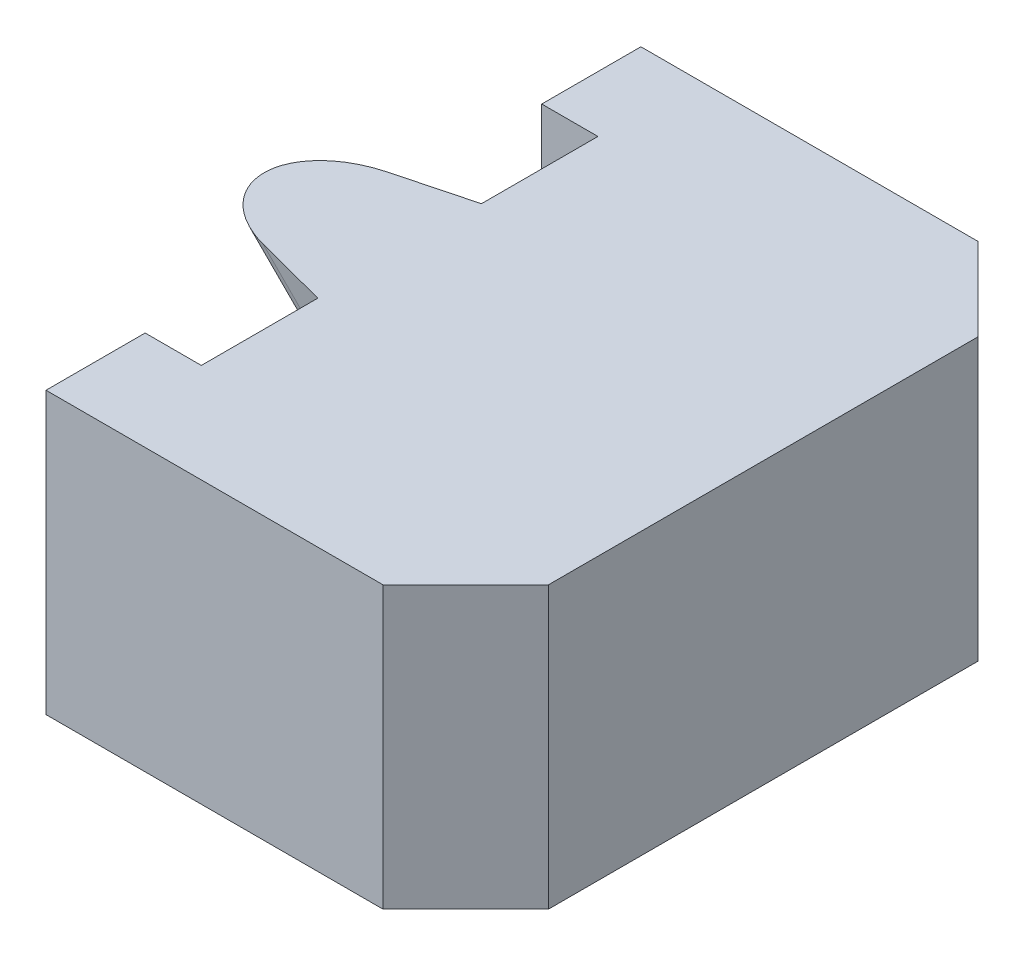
ISO-10303-21;
HEADER;
FILE_DESCRIPTION(('STEP AP214'),'2;1');
FILE_NAME('part.step','',(''),(''),'','','');
FILE_SCHEMA(('AUTOMOTIVE_DESIGN { 1 0 10303 214 1 1 1 1 }'));
ENDSEC;
DATA;
#1=APPLICATION_CONTEXT('core data for automotive mechanical design processes');
#2=APPLICATION_PROTOCOL_DEFINITION('international standard','automotive_design',2000,#1);
#3=PRODUCT_CONTEXT('',#1,'mechanical');
#4=PRODUCT('Part','Part','',(#3));
#5=PRODUCT_RELATED_PRODUCT_CATEGORY('part','',(#4));
#6=PRODUCT_DEFINITION_FORMATION('','',#4);
#7=PRODUCT_DEFINITION_CONTEXT('part definition',#1,'design');
#8=PRODUCT_DEFINITION('design','',#6,#7);
#9=PRODUCT_DEFINITION_SHAPE('','',#8);
#10=(LENGTH_UNIT() NAMED_UNIT(*) SI_UNIT(.MILLI.,.METRE.));
#11=(NAMED_UNIT(*) PLANE_ANGLE_UNIT() SI_UNIT($,.RADIAN.));
#12=(NAMED_UNIT(*) SI_UNIT($,.STERADIAN.) SOLID_ANGLE_UNIT());
#13=UNCERTAINTY_MEASURE_WITH_UNIT(LENGTH_MEASURE(1.E-05),#10,'distance_accuracy_value','');
#14=(GEOMETRIC_REPRESENTATION_CONTEXT(3) GLOBAL_UNCERTAINTY_ASSIGNED_CONTEXT((#13)) GLOBAL_UNIT_ASSIGNED_CONTEXT((#10,
#11,#12)) REPRESENTATION_CONTEXT('',''));
#15=CARTESIAN_POINT('',(0.,0.,0.));
#16=DIRECTION('',(0.,0.,1.));
#17=DIRECTION('',(1.,0.,0.));
#18=AXIS2_PLACEMENT_3D('',#15,#16,#17);
#19=CARTESIAN_POINT('',(-21.6603765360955,-8.5,10.766004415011));
#20=DIRECTION('',(1.,0.,0.));
#21=DIRECTION('',(0.,0.,-1.));
#22=AXIS2_PLACEMENT_3D('',#19,#20,#21);
#23=PLANE('',#22);
#24=DIRECTION('',(0.,0.967111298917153,0.254353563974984));
#25=VECTOR('',#24,1.);
#26=CARTESIAN_POINT('',(-21.6603765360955,-7.2771193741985,6.11632838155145));
#27=LINE('',#26,#25);
#28=CARTESIAN_POINT('',(-21.6603765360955,-5.24830790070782,6.64991270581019));
#29=VERTEX_POINT('',#28);
#30=CARTESIAN_POINT('',(-21.6603765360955,-3.,7.24122533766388));
#31=VERTEX_POINT('',#30);
#32=EDGE_CURVE('E239',#29,#31,#27,.T.);
#33=ORIENTED_EDGE('',*,*,#32,.F.);
#34=CARTESIAN_POINT('',(-21.6603765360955,-4.25735931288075,4.76600441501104));
#35=DIRECTION('',(1.,0.,0.));
#36=DIRECTION('',(0.,-1.,0.));
#37=AXIS2_PLACEMENT_3D('',#34,#35,#36);
#38=ELLIPSE('',#37,2.84256926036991,2.01);
#39=CARTESIAN_POINT('',(-21.6603765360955,-5.24830790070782,2.88209612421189));
#40=VERTEX_POINT('',#39);
#41=EDGE_CURVE('E165',#40,#29,#38,.F.);
#42=ORIENTED_EDGE('',*,*,#41,.F.);
#43=DIRECTION('',(0.,-0.967111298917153,0.254353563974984));
#44=VECTOR('',#43,1.);
#45=CARTESIAN_POINT('',(-21.6603765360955,-10.2289778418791,4.19202927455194));
#46=LINE('',#45,#44);
#47=CARTESIAN_POINT('',(-21.6603765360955,-3.,2.2907834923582));
#48=VERTEX_POINT('',#47);
#49=EDGE_CURVE('E245',#48,#40,#46,.T.);
#50=ORIENTED_EDGE('',*,*,#49,.F.);
#51=DIRECTION('',(0.,0.,-1.));
#52=VECTOR('',#51,1.);
#53=CARTESIAN_POINT('',(-21.6603765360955,-3.,-1.23399558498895));
#54=LINE('',#53,#52);
#55=CARTESIAN_POINT('',(-21.6603765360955,-3.,-1.23399558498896));
#56=VERTEX_POINT('',#55);
#57=EDGE_CURVE('E185',#48,#56,#54,.T.);
#58=ORIENTED_EDGE('',*,*,#57,.T.);
#59=DIRECTION('',(0.,1.,0.));
#60=VECTOR('',#59,1.);
#61=CARTESIAN_POINT('',(-21.6603765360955,-8.5,-1.23399558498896));
#62=LINE('',#61,#60);
#63=CARTESIAN_POINT('',(-21.6603765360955,-8.5,-1.23399558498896));
#64=VERTEX_POINT('',#63);
#65=EDGE_CURVE('E192',#64,#56,#62,.T.);
#66=ORIENTED_EDGE('',*,*,#65,.F.);
#67=DIRECTION('',(0.,0.,-1.));
#68=VECTOR('',#67,1.);
#69=CARTESIAN_POINT('',(-21.6603765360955,-8.5,10.766004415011));
#70=LINE('',#69,#68);
#71=CARTESIAN_POINT('',(-21.6603765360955,-8.5,10.766004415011));
#72=VERTEX_POINT('',#71);
#73=EDGE_CURVE('E212',#72,#64,#70,.T.);
#74=ORIENTED_EDGE('',*,*,#73,.F.);
#75=DIRECTION('',(0.,1.,0.));
#76=VECTOR('',#75,1.);
#77=CARTESIAN_POINT('',(-21.6603765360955,-8.5,10.766004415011));
#78=LINE('',#77,#76);
#79=CARTESIAN_POINT('',(-21.6603765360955,-3.,10.766004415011));
#80=VERTEX_POINT('',#79);
#81=EDGE_CURVE('E189',#72,#80,#78,.T.);
#82=ORIENTED_EDGE('',*,*,#81,.T.);
#83=EDGE_CURVE('E182',#80,#31,#54,.T.);
#84=ORIENTED_EDGE('',*,*,#83,.T.);
#85=EDGE_LOOP('',(#33,#42,#50,#58,#66,#74,#82,#84));
#86=FACE_BOUND('',#85,.T.);
#87=ADVANCED_FACE('F29',(#86),#23,.F.);
#88=CARTESIAN_POINT('',(-24.6603765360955,-3.,10.766004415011));
#89=DIRECTION('',(0.,0.,1.));
#90=DIRECTION('',(1.,0.,0.));
#91=AXIS2_PLACEMENT_3D('',#88,#89,#90);
#92=CYLINDRICAL_SURFACE('',#91,3.);
#93=CARTESIAN_POINT('',(-24.6603765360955,-3.,6.45221512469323));
#94=DIRECTION('',(0.24650462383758,0.246504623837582,-0.937267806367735));
#95=DIRECTION('',(0.662748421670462,0.662748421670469,0.348610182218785));
#96=AXIS2_PLACEMENT_3D('',#93,#94,#95);
#97=ELLIPSE('',#96,3.20079275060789,3.);
#98=CARTESIAN_POINT('',(-24.6603765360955,0.,7.24122533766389));
#99=VERTEX_POINT('',#98);
#100=EDGE_CURVE('E168',#31,#99,#97,.F.);
#101=ORIENTED_EDGE('',*,*,#100,.F.);
#102=ORIENTED_EDGE('',*,*,#83,.F.);
#103=CARTESIAN_POINT('',(-24.6603765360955,-3.,10.766004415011));
#104=DIRECTION('',(0.,0.,1.));
#105=DIRECTION('',(1.,0.,0.));
#106=AXIS2_PLACEMENT_3D('',#103,#104,#105);
#107=CIRCLE('',#106,3.);
#108=CARTESIAN_POINT('',(-24.6603765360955,0.,10.766004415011));
#109=VERTEX_POINT('',#108);
#110=EDGE_CURVE('E174',#109,#80,#107,.F.);
#111=ORIENTED_EDGE('',*,*,#110,.F.);
#112=DIRECTION('',(0.,0.,-1.));
#113=VECTOR('',#112,1.);
#114=CARTESIAN_POINT('',(-24.6603765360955,0.,10.766004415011));
#115=LINE('',#114,#113);
#116=EDGE_CURVE('E178',#99,#109,#115,.F.);
#117=ORIENTED_EDGE('',*,*,#116,.F.);
#118=EDGE_LOOP('',(#101,#102,#111,#117));
#119=FACE_BOUND('',#118,.T.);
#120=ADVANCED_FACE('F270',(#119),#92,.F.);
#121=CARTESIAN_POINT('',(-24.6603765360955,-3.,3.07979370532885));
#122=DIRECTION('',(0.24650462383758,0.246504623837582,0.937267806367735));
#123=DIRECTION('',(-0.662748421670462,-0.662748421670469,0.348610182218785));
#124=AXIS2_PLACEMENT_3D('',#121,#122,#123);
#125=ELLIPSE('',#124,3.20079275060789,3.);
#126=CARTESIAN_POINT('',(-24.6603765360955,0.,2.29078349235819));
#127=VERTEX_POINT('',#126);
#128=EDGE_CURVE('E171',#127,#48,#125,.F.);
#129=ORIENTED_EDGE('',*,*,#128,.F.);
#130=CARTESIAN_POINT('',(-24.6603765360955,0.,-1.23399558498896));
#131=VERTEX_POINT('',#130);
#132=EDGE_CURVE('E176',#131,#127,#115,.F.);
#133=ORIENTED_EDGE('',*,*,#132,.F.);
#134=CARTESIAN_POINT('',(-24.6603765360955,-3.,-1.23399558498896));
#135=DIRECTION('',(0.,0.,-1.));
#136=DIRECTION('',(-1.,0.,0.));
#137=AXIS2_PLACEMENT_3D('',#134,#135,#136);
#138=CIRCLE('',#137,3.);
#139=EDGE_CURVE('E179',#56,#131,#138,.F.);
#140=ORIENTED_EDGE('',*,*,#139,.F.);
#141=ORIENTED_EDGE('',*,*,#57,.F.);
#142=EDGE_LOOP('',(#129,#133,#140,#141));
#143=FACE_BOUND('',#142,.T.);
#144=ADVANCED_FACE('F299',(#143),#92,.F.);
#145=CARTESIAN_POINT('',(-26.3603765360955,-8.5,13.766004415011));
#146=DIRECTION('',(1.,0.,0.));
#147=DIRECTION('',(0.,0.,-1.));
#148=AXIS2_PLACEMENT_3D('',#145,#146,#147);
#149=PLANE('',#148);
#150=DIRECTION('',(0.,0.,-1.));
#151=VECTOR('',#150,1.);
#152=CARTESIAN_POINT('',(-26.3603765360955,0.,13.766004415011));
#153=LINE('',#152,#151);
#154=CARTESIAN_POINT('',(-26.3603765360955,0.,13.766004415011));
#155=VERTEX_POINT('',#154);
#156=CARTESIAN_POINT('',(-26.3603765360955,0.,10.766004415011));
#157=VERTEX_POINT('',#156);
#158=EDGE_CURVE('E230',#155,#157,#153,.T.);
#159=ORIENTED_EDGE('',*,*,#158,.T.);
#160=DIRECTION('',(0.,1.,0.));
#161=VECTOR('',#160,1.);
#162=CARTESIAN_POINT('',(-26.3603765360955,-8.5,10.766004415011));
#163=LINE('',#162,#161);
#164=CARTESIAN_POINT('',(-26.3603765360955,-8.5,10.766004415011));
#165=VERTEX_POINT('',#164);
#166=EDGE_CURVE('E186',#165,#157,#163,.T.);
#167=ORIENTED_EDGE('',*,*,#166,.F.);
#168=DIRECTION('',(0.,0.,-1.));
#169=VECTOR('',#168,1.);
#170=CARTESIAN_POINT('',(-26.3603765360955,-8.5,13.766004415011));
#171=LINE('',#170,#169);
#172=CARTESIAN_POINT('',(-26.3603765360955,-8.5,13.766004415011));
#173=VERTEX_POINT('',#172);
#174=EDGE_CURVE('E216',#173,#165,#171,.T.);
#175=ORIENTED_EDGE('',*,*,#174,.F.);
#176=DIRECTION('',(0.,1.,0.));
#177=VECTOR('',#176,1.);
#178=CARTESIAN_POINT('',(-26.3603765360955,-8.5,13.766004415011));
#179=LINE('',#178,#177);
#180=EDGE_CURVE('E199',#173,#155,#179,.T.);
#181=ORIENTED_EDGE('',*,*,#180,.T.);
#182=EDGE_LOOP('',(#159,#167,#175,#181));
#183=FACE_BOUND('',#182,.T.);
#184=ADVANCED_FACE('F31',(#183),#149,.F.);
#185=CARTESIAN_POINT('',(-26.3603765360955,-8.5,10.766004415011));
#186=DIRECTION('',(0.,0.,1.));
#187=DIRECTION('',(1.,0.,0.));
#188=AXIS2_PLACEMENT_3D('',#185,#186,#187);
#189=PLANE('',#188);
#190=DIRECTION('',(1.,0.,0.));
#191=VECTOR('',#190,1.);
#192=CARTESIAN_POINT('',(-26.3603765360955,0.,10.766004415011));
#193=LINE('',#192,#191);
#194=EDGE_CURVE('E227',#157,#109,#193,.T.);
#195=ORIENTED_EDGE('',*,*,#194,.T.);
#196=ORIENTED_EDGE('',*,*,#110,.T.);
#197=ORIENTED_EDGE('',*,*,#81,.F.);
#198=DIRECTION('',(1.,0.,0.));
#199=VECTOR('',#198,1.);
#200=CARTESIAN_POINT('',(-26.3603765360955,-8.5,10.766004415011));
#201=LINE('',#200,#199);
#202=EDGE_CURVE('E214',#165,#72,#201,.T.);
#203=ORIENTED_EDGE('',*,*,#202,.F.);
#204=ORIENTED_EDGE('',*,*,#166,.T.);
#205=EDGE_LOOP('',(#195,#196,#197,#203,#204));
#206=FACE_BOUND('',#205,.T.);
#207=ADVANCED_FACE('F273',(#206),#189,.F.);
#208=CARTESIAN_POINT('',(-21.6603765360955,-8.5,-1.23399558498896));
#209=DIRECTION('',(0.,0.,-1.));
#210=DIRECTION('',(-1.,0.,0.));
#211=AXIS2_PLACEMENT_3D('',#208,#209,#210);
#212=PLANE('',#211);
#213=ORIENTED_EDGE('',*,*,#65,.T.);
#214=ORIENTED_EDGE('',*,*,#139,.T.);
#215=DIRECTION('',(-1.,0.,0.));
#216=VECTOR('',#215,1.);
#217=CARTESIAN_POINT('',(-21.6603765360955,0.,-1.23399558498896));
#218=LINE('',#217,#216);
#219=CARTESIAN_POINT('',(-26.3603765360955,0.,-1.23399558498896));
#220=VERTEX_POINT('',#219);
#221=EDGE_CURVE('E224',#131,#220,#218,.T.);
#222=ORIENTED_EDGE('',*,*,#221,.T.);
#223=DIRECTION('',(0.,1.,0.));
#224=VECTOR('',#223,1.);
#225=CARTESIAN_POINT('',(-26.3603765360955,-8.5,-1.23399558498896));
#226=LINE('',#225,#224);
#227=CARTESIAN_POINT('',(-26.3603765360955,-8.5,-1.23399558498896));
#228=VERTEX_POINT('',#227);
#229=EDGE_CURVE('E195',#228,#220,#226,.T.);
#230=ORIENTED_EDGE('',*,*,#229,.F.);
#231=DIRECTION('',(-1.,0.,0.));
#232=VECTOR('',#231,1.);
#233=CARTESIAN_POINT('',(-21.6603765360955,-8.5,-1.23399558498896));
#234=LINE('',#233,#232);
#235=EDGE_CURVE('E210',#64,#228,#234,.T.);
#236=ORIENTED_EDGE('',*,*,#235,.F.);
#237=EDGE_LOOP('',(#213,#214,#222,#230,#236));
#238=FACE_BOUND('',#237,.T.);
#239=ADVANCED_FACE('F296',(#238),#212,.F.);
#240=CARTESIAN_POINT('',(-26.3603765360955,-8.5,-4.23399558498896));
#241=DIRECTION('',(1.,0.,0.));
#242=DIRECTION('',(0.,0.,-1.));
#243=AXIS2_PLACEMENT_3D('',#240,#241,#242);
#244=PLANE('',#243);
#245=DIRECTION('',(0.,0.,-1.));
#246=VECTOR('',#245,1.);
#247=CARTESIAN_POINT('',(-26.3603765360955,0.,-4.23399558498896));
#248=LINE('',#247,#246);
#249=CARTESIAN_POINT('',(-26.3603765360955,0.,-4.23399558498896));
#250=VERTEX_POINT('',#249);
#251=EDGE_CURVE('E149',#220,#250,#248,.T.);
#252=ORIENTED_EDGE('',*,*,#251,.T.);
#253=DIRECTION('',(0.,1.,0.));
#254=VECTOR('',#253,1.);
#255=CARTESIAN_POINT('',(-26.3603765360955,-8.5,-4.23399558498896));
#256=LINE('',#255,#254);
#257=CARTESIAN_POINT('',(-26.3603765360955,-8.5,-4.23399558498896));
#258=VERTEX_POINT('',#257);
#259=EDGE_CURVE('E148',#258,#250,#256,.T.);
#260=ORIENTED_EDGE('',*,*,#259,.F.);
#261=DIRECTION('',(0.,0.,-1.));
#262=VECTOR('',#261,1.);
#263=CARTESIAN_POINT('',(-26.3603765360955,-8.5,-4.23399558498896));
#264=LINE('',#263,#262);
#265=EDGE_CURVE('E208',#228,#258,#264,.T.);
#266=ORIENTED_EDGE('',*,*,#265,.F.);
#267=ORIENTED_EDGE('',*,*,#229,.T.);
#268=EDGE_LOOP('',(#252,#260,#266,#267));
#269=FACE_BOUND('',#268,.T.);
#270=ADVANCED_FACE('F294',(#269),#244,.F.);
#271=CARTESIAN_POINT('',(-26.3603765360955,-8.5,-4.23399558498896));
#272=DIRECTION('',(0.,0.,1.));
#273=DIRECTION('',(1.,0.,0.));
#274=AXIS2_PLACEMENT_3D('',#271,#272,#273);
#275=PLANE('',#274);
#276=DIRECTION('',(1.,0.,0.));
#277=VECTOR('',#276,1.);
#278=CARTESIAN_POINT('',(-26.3603765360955,0.,-4.23399558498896));
#279=LINE('',#278,#277);
#280=CARTESIAN_POINT('',(-16.1603765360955,0.,-4.23399558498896));
#281=VERTEX_POINT('',#280);
#282=EDGE_CURVE('E139',#250,#281,#279,.T.);
#283=ORIENTED_EDGE('',*,*,#282,.T.);
#284=DIRECTION('',(0.,-1.,0.));
#285=VECTOR('',#284,1.);
#286=CARTESIAN_POINT('',(-16.1603765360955,-8.5,-4.23399558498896));
#287=LINE('',#286,#285);
#288=CARTESIAN_POINT('',(-16.1603765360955,-8.5,-4.23399558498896));
#289=VERTEX_POINT('',#288);
#290=EDGE_CURVE('E44',#281,#289,#287,.T.);
#291=ORIENTED_EDGE('',*,*,#290,.T.);
#292=DIRECTION('',(1.,0.,0.));
#293=VECTOR('',#292,1.);
#294=CARTESIAN_POINT('',(-26.3603765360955,-8.5,-4.23399558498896));
#295=LINE('',#294,#293);
#296=EDGE_CURVE('E206',#258,#289,#295,.T.);
#297=ORIENTED_EDGE('',*,*,#296,.F.);
#298=ORIENTED_EDGE('',*,*,#259,.T.);
#299=EDGE_LOOP('',(#283,#291,#297,#298));
#300=FACE_BOUND('',#299,.T.);
#301=ADVANCED_FACE('F146',(#300),#275,.F.);
#302=CARTESIAN_POINT('',(-13.6603765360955,-8.5,13.766004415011));
#303=DIRECTION('',(-1.,0.,0.));
#304=DIRECTION('',(0.,0.,1.));
#305=AXIS2_PLACEMENT_3D('',#302,#303,#304);
#306=PLANE('',#305);
#307=DIRECTION('',(0.,0.,1.));
#308=VECTOR('',#307,1.);
#309=CARTESIAN_POINT('',(-13.6603765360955,0.,13.766004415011));
#310=LINE('',#309,#308);
#311=CARTESIAN_POINT('',(-13.6603765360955,0.,-1.73399558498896));
#312=VERTEX_POINT('',#311);
#313=CARTESIAN_POINT('',(-13.6603765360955,0.,11.266004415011));
#314=VERTEX_POINT('',#313);
#315=EDGE_CURVE('E141',#312,#314,#310,.T.);
#316=ORIENTED_EDGE('',*,*,#315,.T.);
#317=DIRECTION('',(0.,-1.,0.));
#318=VECTOR('',#317,1.);
#319=CARTESIAN_POINT('',(-13.6603765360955,-8.5,11.266004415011));
#320=LINE('',#319,#318);
#321=CARTESIAN_POINT('',(-13.6603765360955,-8.5,11.266004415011));
#322=VERTEX_POINT('',#321);
#323=EDGE_CURVE('E52',#314,#322,#320,.T.);
#324=ORIENTED_EDGE('',*,*,#323,.T.);
#325=DIRECTION('',(0.,0.,1.));
#326=VECTOR('',#325,1.);
#327=CARTESIAN_POINT('',(-13.6603765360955,-8.5,13.766004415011));
#328=LINE('',#327,#326);
#329=CARTESIAN_POINT('',(-13.6603765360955,-8.5,-1.73399558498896));
#330=VERTEX_POINT('',#329);
#331=EDGE_CURVE('E204',#330,#322,#328,.T.);
#332=ORIENTED_EDGE('',*,*,#331,.F.);
#333=DIRECTION('',(0.,1.,0.));
#334=VECTOR('',#333,1.);
#335=CARTESIAN_POINT('',(-13.6603765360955,-8.5,-1.73399558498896));
#336=LINE('',#335,#334);
#337=EDGE_CURVE('E160',#330,#312,#336,.T.);
#338=ORIENTED_EDGE('',*,*,#337,.T.);
#339=EDGE_LOOP('',(#316,#324,#332,#338));
#340=FACE_BOUND('',#339,.T.);
#341=ADVANCED_FACE('F291',(#340),#306,.F.);
#342=CARTESIAN_POINT('',(-26.3603765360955,-8.5,13.766004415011));
#343=DIRECTION('',(0.,0.,-1.));
#344=DIRECTION('',(-1.,0.,0.));
#345=AXIS2_PLACEMENT_3D('',#342,#343,#344);
#346=PLANE('',#345);
#347=DIRECTION('',(-1.,0.,0.));
#348=VECTOR('',#347,1.);
#349=CARTESIAN_POINT('',(-26.3603765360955,-8.5,13.766004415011));
#350=LINE('',#349,#348);
#351=CARTESIAN_POINT('',(-16.1603765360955,-8.5,13.766004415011));
#352=VERTEX_POINT('',#351);
#353=EDGE_CURVE('E202',#352,#173,#350,.T.);
#354=ORIENTED_EDGE('',*,*,#353,.F.);
#355=DIRECTION('',(0.,1.,0.));
#356=VECTOR('',#355,1.);
#357=CARTESIAN_POINT('',(-16.1603765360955,-8.5,13.766004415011));
#358=LINE('',#357,#356);
#359=CARTESIAN_POINT('',(-16.1603765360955,0.,13.766004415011));
#360=VERTEX_POINT('',#359);
#361=EDGE_CURVE('E162',#352,#360,#358,.T.);
#362=ORIENTED_EDGE('',*,*,#361,.T.);
#363=DIRECTION('',(-1.,0.,0.));
#364=VECTOR('',#363,1.);
#365=CARTESIAN_POINT('',(-26.3603765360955,0.,13.766004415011));
#366=LINE('',#365,#364);
#367=EDGE_CURVE('E219',#360,#155,#366,.T.);
#368=ORIENTED_EDGE('',*,*,#367,.T.);
#369=ORIENTED_EDGE('',*,*,#180,.F.);
#370=EDGE_LOOP('',(#354,#362,#368,#369));
#371=FACE_BOUND('',#370,.T.);
#372=ADVANCED_FACE('F286',(#371),#346,.F.);
#373=CARTESIAN_POINT('',(-26.3603765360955,-8.5,10.766004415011));
#374=DIRECTION('',(0.,-1.,0.));
#375=DIRECTION('',(0.,0.,-1.));
#376=AXIS2_PLACEMENT_3D('',#373,#374,#375);
#377=PLANE('',#376);
#378=ORIENTED_EDGE('',*,*,#331,.T.);
#379=DIRECTION('',(0.707106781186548,0.,-0.707106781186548));
#380=VECTOR('',#379,1.);
#381=CARTESIAN_POINT('',(-19.7603765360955,-8.5,17.366004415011));
#382=LINE('',#381,#380);
#383=EDGE_CURVE('E154',#322,#352,#382,.F.);
#384=ORIENTED_EDGE('',*,*,#383,.T.);
#385=ORIENTED_EDGE('',*,*,#353,.T.);
#386=ORIENTED_EDGE('',*,*,#174,.T.);
#387=ORIENTED_EDGE('',*,*,#202,.T.);
#388=ORIENTED_EDGE('',*,*,#73,.T.);
#389=ORIENTED_EDGE('',*,*,#235,.T.);
#390=ORIENTED_EDGE('',*,*,#265,.T.);
#391=ORIENTED_EDGE('',*,*,#296,.T.);
#392=DIRECTION('',(-0.707106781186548,0.,-0.707106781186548));
#393=VECTOR('',#392,1.);
#394=CARTESIAN_POINT('',(-13.7603765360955,-8.5,-1.83399558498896));
#395=LINE('',#394,#393);
#396=EDGE_CURVE('E153',#289,#330,#395,.F.);
#397=ORIENTED_EDGE('',*,*,#396,.T.);
#398=EDGE_LOOP('',(#378,#384,#385,#386,#387,#388,#389,#390,#391,#397));
#399=FACE_BOUND('',#398,.T.);
#400=ADVANCED_FACE('F277',(#399),#377,.T.);
#401=CARTESIAN_POINT('',(-33.6811918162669,7.76345596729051,4.76600441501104));
#402=DIRECTION('',(0.707106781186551,-0.707106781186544,0.));
#403=DIRECTION('',(0.707106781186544,0.707106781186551,0.));
#404=AXIS2_PLACEMENT_3D('',#401,#402,#403);
#405=CYLINDRICAL_SURFACE('',#404,2.01);
#406=DIRECTION('',(0.707106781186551,-0.707106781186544,0.));
#407=VECTOR('',#406,1.);
#408=CARTESIAN_POINT('',(-34.1766661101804,7.26798167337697,6.64991270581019));
#409=LINE('',#408,#407);
#410=CARTESIAN_POINT('',(-26.9086844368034,0.,6.64991270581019));
#411=VERTEX_POINT('',#410);
#412=EDGE_CURVE('E248',#411,#29,#409,.T.);
#413=ORIENTED_EDGE('',*,*,#412,.F.);
#414=CARTESIAN_POINT('',(-25.9177358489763,0.,4.76600441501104));
#415=DIRECTION('',(0.,1.,0.));
#416=DIRECTION('',(1.,0.,0.));
#417=AXIS2_PLACEMENT_3D('',#414,#415,#416);
#418=ELLIPSE('',#417,2.84256926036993,2.01);
#419=CARTESIAN_POINT('',(-26.9086844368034,0.,2.88209612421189));
#420=VERTEX_POINT('',#419);
#421=EDGE_CURVE('E233',#411,#420,#418,.F.);
#422=ORIENTED_EDGE('',*,*,#421,.T.);
#423=DIRECTION('',(0.707106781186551,-0.707106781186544,0.));
#424=VECTOR('',#423,1.);
#425=CARTESIAN_POINT('',(-34.1766661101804,7.26798167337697,2.88209612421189));
#426=LINE('',#425,#424);
#427=EDGE_CURVE('E251',#420,#40,#426,.T.);
#428=ORIENTED_EDGE('',*,*,#427,.T.);
#429=ORIENTED_EDGE('',*,*,#41,.T.);
#430=EDGE_LOOP('',(#413,#422,#428,#429));
#431=FACE_BOUND('',#430,.T.);
#432=ADVANCED_FACE('F256',(#431),#405,.T.);
#433=CARTESIAN_POINT('',(-34.1766661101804,7.26798167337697,6.64991270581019));
#434=DIRECTION('',(0.24650462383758,0.246504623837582,-0.937267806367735));
#435=DIRECTION('',(0.,0.967111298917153,0.254353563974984));
#436=AXIS2_PLACEMENT_3D('',#433,#434,#435);
#437=PLANE('',#436);
#438=ORIENTED_EDGE('',*,*,#100,.T.);
#439=DIRECTION('',(-0.967111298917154,0.,-0.254353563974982));
#440=VECTOR('',#439,1.);
#441=CARTESIAN_POINT('',(-36.9606134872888,0.,4.00622114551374));
#442=LINE('',#441,#440);
#443=EDGE_CURVE('E236',#99,#411,#442,.T.);
#444=ORIENTED_EDGE('',*,*,#443,.T.);
#445=ORIENTED_EDGE('',*,*,#412,.T.);
#446=ORIENTED_EDGE('',*,*,#32,.T.);
#447=EDGE_LOOP('',(#438,#444,#445,#446));
#448=FACE_BOUND('',#447,.T.);
#449=ADVANCED_FACE('F266',(#448),#437,.F.);
#450=CARTESIAN_POINT('',(-34.1766661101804,7.26798167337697,2.88209612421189));
#451=DIRECTION('',(0.24650462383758,0.246504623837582,0.937267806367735));
#452=DIRECTION('',(0.,-0.967111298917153,0.254353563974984));
#453=AXIS2_PLACEMENT_3D('',#450,#451,#452);
#454=PLANE('',#453);
#455=ORIENTED_EDGE('',*,*,#427,.F.);
#456=DIRECTION('',(0.967111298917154,0.,-0.254353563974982));
#457=VECTOR('',#456,1.);
#458=CARTESIAN_POINT('',(-51.0291839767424,0.,9.22586961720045));
#459=LINE('',#458,#457);
#460=EDGE_CURVE('E242',#420,#127,#459,.T.);
#461=ORIENTED_EDGE('',*,*,#460,.T.);
#462=ORIENTED_EDGE('',*,*,#128,.T.);
#463=ORIENTED_EDGE('',*,*,#49,.T.);
#464=EDGE_LOOP('',(#455,#461,#462,#463));
#465=FACE_BOUND('',#464,.T.);
#466=ADVANCED_FACE('F258',(#465),#454,.F.);
#467=CARTESIAN_POINT('',(-16.1603765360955,-8.5,13.766004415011));
#468=DIRECTION('',(-0.707106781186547,0.,-0.707106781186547));
#469=DIRECTION('',(-0.707106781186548,0.,0.707106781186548));
#470=AXIS2_PLACEMENT_3D('',#467,#468,#469);
#471=PLANE('',#470);
#472=ORIENTED_EDGE('',*,*,#383,.F.);
#473=ORIENTED_EDGE('',*,*,#323,.F.);
#474=DIRECTION('',(-0.707106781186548,0.,0.707106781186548));
#475=VECTOR('',#474,1.);
#476=CARTESIAN_POINT('',(-40.2188472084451,0.,37.8244750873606));
#477=LINE('',#476,#475);
#478=EDGE_CURVE('E37',#360,#314,#477,.F.);
#479=ORIENTED_EDGE('',*,*,#478,.F.);
#480=ORIENTED_EDGE('',*,*,#361,.F.);
#481=EDGE_LOOP('',(#472,#473,#479,#480));
#482=FACE_BOUND('',#481,.T.);
#483=ADVANCED_FACE('F290',(#482),#471,.F.);
#484=CARTESIAN_POINT('',(-13.6603765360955,-8.5,-1.73399558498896));
#485=DIRECTION('',(-0.707106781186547,0.,0.707106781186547));
#486=DIRECTION('',(0.707106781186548,0.,0.707106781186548));
#487=AXIS2_PLACEMENT_3D('',#484,#485,#486);
#488=PLANE('',#487);
#489=ORIENTED_EDGE('',*,*,#396,.F.);
#490=ORIENTED_EDGE('',*,*,#290,.F.);
#491=DIRECTION('',(0.707106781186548,0.,0.707106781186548));
#492=VECTOR('',#491,1.);
#493=CARTESIAN_POINT('',(-11.6228207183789,0.,0.303560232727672));
#494=LINE('',#493,#492);
#495=EDGE_CURVE('E11',#312,#281,#494,.F.);
#496=ORIENTED_EDGE('',*,*,#495,.F.);
#497=ORIENTED_EDGE('',*,*,#337,.F.);
#498=EDGE_LOOP('',(#489,#490,#496,#497));
#499=FACE_BOUND('',#498,.T.);
#500=ADVANCED_FACE('F152',(#499),#488,.F.);
#501=CARTESIAN_POINT('',(41.1067880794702,0.,120.056001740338));
#502=DIRECTION('',(0.,-1.,0.));
#503=DIRECTION('',(0.,0.,-1.));
#504=AXIS2_PLACEMENT_3D('',#501,#502,#503);
#505=PLANE('',#504);
#506=ORIENTED_EDGE('',*,*,#194,.F.);
#507=ORIENTED_EDGE('',*,*,#158,.F.);
#508=ORIENTED_EDGE('',*,*,#367,.F.);
#509=ORIENTED_EDGE('',*,*,#478,.T.);
#510=ORIENTED_EDGE('',*,*,#315,.F.);
#511=ORIENTED_EDGE('',*,*,#495,.T.);
#512=ORIENTED_EDGE('',*,*,#282,.F.);
#513=ORIENTED_EDGE('',*,*,#251,.F.);
#514=ORIENTED_EDGE('',*,*,#221,.F.);
#515=ORIENTED_EDGE('',*,*,#132,.T.);
#516=ORIENTED_EDGE('',*,*,#460,.F.);
#517=ORIENTED_EDGE('',*,*,#421,.F.);
#518=ORIENTED_EDGE('',*,*,#443,.F.);
#519=ORIENTED_EDGE('',*,*,#116,.T.);
#520=EDGE_LOOP('',(#506,#507,#508,#509,#510,#511,#512,#513,#514,#515,#516,#517,#518,#519));
#521=FACE_BOUND('',#520,.T.);
#522=ADVANCED_FACE('F138',(#521),#505,.F.);
#523=CLOSED_SHELL('',(#87,#120,#144,#184,#207,#239,#270,#301,#341,#372,#400,#432,#449,#466,#483,
#500,#522));
#524=MANIFOLD_SOLID_BREP('B2',#523);
#525=ADVANCED_BREP_SHAPE_REPRESENTATION('',(#18,#524),#14);
#526=SHAPE_DEFINITION_REPRESENTATION(#9,#525);
ENDSEC;
END-ISO-10303-21;
